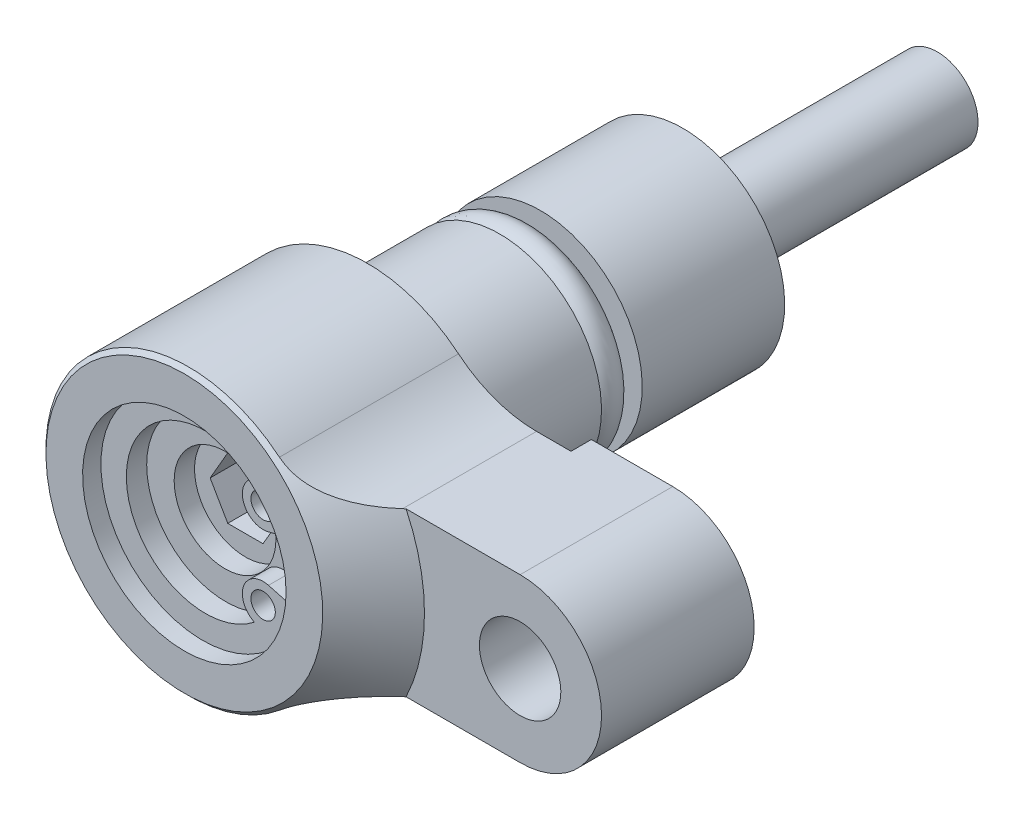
ISO-10303-21;
HEADER;
FILE_DESCRIPTION(('STEP AP214'),'2;1');
FILE_NAME('part.step','',(''),(''),'','','');
FILE_SCHEMA(('AUTOMOTIVE_DESIGN { 1 0 10303 214 1 1 1 1 }'));
ENDSEC;
DATA;
#1=APPLICATION_CONTEXT('core data for automotive mechanical design processes');
#2=APPLICATION_PROTOCOL_DEFINITION('international standard','automotive_design',2000,#1);
#3=PRODUCT_CONTEXT('',#1,'mechanical');
#4=PRODUCT('Part','Part','',(#3));
#5=PRODUCT_RELATED_PRODUCT_CATEGORY('part','',(#4));
#6=PRODUCT_DEFINITION_FORMATION('','',#4);
#7=PRODUCT_DEFINITION_CONTEXT('part definition',#1,'design');
#8=PRODUCT_DEFINITION('design','',#6,#7);
#9=PRODUCT_DEFINITION_SHAPE('','',#8);
#10=(LENGTH_UNIT() NAMED_UNIT(*) SI_UNIT(.MILLI.,.METRE.));
#11=(NAMED_UNIT(*) PLANE_ANGLE_UNIT() SI_UNIT($,.RADIAN.));
#12=(NAMED_UNIT(*) SI_UNIT($,.STERADIAN.) SOLID_ANGLE_UNIT());
#13=UNCERTAINTY_MEASURE_WITH_UNIT(LENGTH_MEASURE(1.E-05),#10,'distance_accuracy_value','');
#14=(GEOMETRIC_REPRESENTATION_CONTEXT(3) GLOBAL_UNCERTAINTY_ASSIGNED_CONTEXT((#13)) GLOBAL_UNIT_ASSIGNED_CONTEXT((#10,
#11,#12)) REPRESENTATION_CONTEXT('',''));
#15=CARTESIAN_POINT('',(0.,0.,0.));
#16=DIRECTION('',(0.,0.,1.));
#17=DIRECTION('',(1.,0.,0.));
#18=AXIS2_PLACEMENT_3D('',#15,#16,#17);
#19=CARTESIAN_POINT('',(-3.75,0.,-5.5));
#20=DIRECTION('',(0.,0.,-1.));
#21=DIRECTION('',(0.,-1.,0.));
#22=AXIS2_PLACEMENT_3D('',#19,#20,#21);
#23=PLANE('',#22);
#24=CARTESIAN_POINT('',(0.,0.,-5.5));
#25=DIRECTION('',(0.,0.,-1.));
#26=DIRECTION('',(0.,-1.,0.));
#27=AXIS2_PLACEMENT_3D('',#24,#25,#26);
#28=CIRCLE('',#27,5.);
#29=CARTESIAN_POINT('',(0.,-5.,-5.5));
#30=VERTEX_POINT('',#29);
#31=EDGE_CURVE('E150',#30,#30,#28,.T.);
#32=ORIENTED_EDGE('',*,*,#31,.T.);
#33=EDGE_LOOP('',(#32));
#34=FACE_BOUND('',#33,.T.);
#35=CARTESIAN_POINT('',(0.,0.,-5.5));
#36=DIRECTION('',(0.,0.,1.));
#37=DIRECTION('',(0.,-1.,0.));
#38=AXIS2_PLACEMENT_3D('',#35,#36,#37);
#39=CIRCLE('',#38,4.375);
#40=CARTESIAN_POINT('',(0.,-4.375,-5.5));
#41=VERTEX_POINT('',#40);
#42=EDGE_CURVE('E592',#41,#41,#39,.T.);
#43=ORIENTED_EDGE('',*,*,#42,.T.);
#44=EDGE_LOOP('',(#43));
#45=FACE_BOUND('',#44,.T.);
#46=ADVANCED_FACE('F14',(#34,#45),#23,.T.);
#47=CARTESIAN_POINT('',(0.,0.,8.));
#48=DIRECTION('',(0.,0.,-1.));
#49=DIRECTION('',(-0.335349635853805,0.942093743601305,0.));
#50=AXIS2_PLACEMENT_3D('',#47,#48,#49);
#51=CYLINDRICAL_SURFACE('',#50,2.5);
#52=CARTESIAN_POINT('',(0.,0.,8.));
#53=DIRECTION('',(0.,0.,1.));
#54=DIRECTION('',(0.335349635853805,-0.942093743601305,0.));
#55=AXIS2_PLACEMENT_3D('',#52,#53,#54);
#56=CIRCLE('',#55,2.5);
#57=CARTESIAN_POINT('',(0.838374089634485,-2.35523435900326,8.));
#58=VERTEX_POINT('',#57);
#59=EDGE_CURVE('E129',#58,#58,#56,.T.);
#60=ORIENTED_EDGE('',*,*,#59,.T.);
#61=EDGE_LOOP('',(#60));
#62=FACE_BOUND('',#61,.T.);
#63=CARTESIAN_POINT('',(0.,0.,7.));
#64=DIRECTION('',(0.,0.,-1.));
#65=DIRECTION('',(-1.,0.,0.));
#66=AXIS2_PLACEMENT_3D('',#63,#64,#65);
#67=CIRCLE('',#66,2.5);
#68=CARTESIAN_POINT('',(-2.50000000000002,0.,6.99999999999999));
#69=VERTEX_POINT('',#68);
#70=EDGE_CURVE('E18',#69,#69,#67,.T.);
#71=ORIENTED_EDGE('',*,*,#70,.T.);
#72=EDGE_LOOP('',(#71));
#73=FACE_BOUND('',#72,.T.);
#74=ADVANCED_FACE('F244',(#62,#73),#51,.F.);
#75=CARTESIAN_POINT('',(2.87075876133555,2.12283644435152,9.));
#76=DIRECTION('',(0.,0.,-1.));
#77=DIRECTION('',(-1.,0.,0.));
#78=AXIS2_PLACEMENT_3D('',#75,#76,#77);
#79=CYLINDRICAL_SURFACE('',#78,0.6);
#80=CARTESIAN_POINT('',(2.87075876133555,2.12283644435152,9.));
#81=DIRECTION('',(0.,0.,1.));
#82=DIRECTION('',(-1.,0.,0.));
#83=AXIS2_PLACEMENT_3D('',#80,#81,#82);
#84=CIRCLE('',#83,0.6);
#85=CARTESIAN_POINT('',(2.27075876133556,2.12283644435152,9.));
#86=VERTEX_POINT('',#85);
#87=EDGE_CURVE('E293',#86,#86,#84,.T.);
#88=ORIENTED_EDGE('',*,*,#87,.T.);
#89=EDGE_LOOP('',(#88));
#90=FACE_BOUND('',#89,.T.);
#91=CARTESIAN_POINT('',(2.87075876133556,2.12283644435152,8.));
#92=DIRECTION('',(0.,0.,1.));
#93=DIRECTION('',(-1.,0.,0.));
#94=AXIS2_PLACEMENT_3D('',#91,#92,#93);
#95=CIRCLE('',#94,0.6);
#96=CARTESIAN_POINT('',(2.27075876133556,2.12283644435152,8.));
#97=VERTEX_POINT('',#96);
#98=EDGE_CURVE('E297',#97,#97,#95,.T.);
#99=ORIENTED_EDGE('',*,*,#98,.F.);
#100=EDGE_LOOP('',(#99));
#101=FACE_BOUND('',#100,.T.);
#102=ADVANCED_FACE('F251',(#90,#101),#79,.F.);
#103=CARTESIAN_POINT('',(0.0360830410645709,0.,9.));
#104=DIRECTION('',(0.,0.,-1.));
#105=DIRECTION('',(-1.,0.,0.));
#106=AXIS2_PLACEMENT_3D('',#103,#104,#105);
#107=CYLINDRICAL_SURFACE('',#106,3.88608304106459);
#108=CARTESIAN_POINT('',(0.0360830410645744,0.,8.));
#109=DIRECTION('',(0.,0.,-1.));
#110=DIRECTION('',(1.,0.,0.));
#111=AXIS2_PLACEMENT_3D('',#108,#109,#110);
#112=CIRCLE('',#111,3.88608304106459);
#113=CARTESIAN_POINT('',(2.4443821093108,-3.04987491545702,8.));
#114=VERTEX_POINT('',#113);
#115=CARTESIAN_POINT('',(2.44438210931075,3.04987491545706,8.));
#116=VERTEX_POINT('',#115);
#117=EDGE_CURVE('E309',#114,#116,#112,.T.);
#118=ORIENTED_EDGE('',*,*,#117,.T.);
#119=DIRECTION('',(0.,0.,-1.));
#120=VECTOR('',#119,1.);
#121=CARTESIAN_POINT('',(2.44438210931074,3.04987491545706,9.));
#122=LINE('',#121,#120);
#123=CARTESIAN_POINT('',(2.44438210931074,3.04987491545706,9.));
#124=VERTEX_POINT('',#123);
#125=EDGE_CURVE('E321',#124,#116,#122,.T.);
#126=ORIENTED_EDGE('',*,*,#125,.F.);
#127=CARTESIAN_POINT('',(0.0360830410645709,0.,9.));
#128=DIRECTION('',(0.,0.,-1.));
#129=DIRECTION('',(1.,0.,0.));
#130=AXIS2_PLACEMENT_3D('',#127,#128,#129);
#131=CIRCLE('',#130,3.88608304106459);
#132=CARTESIAN_POINT('',(2.44438210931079,-3.04987491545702,9.));
#133=VERTEX_POINT('',#132);
#134=EDGE_CURVE('E33',#133,#124,#131,.T.);
#135=ORIENTED_EDGE('',*,*,#134,.F.);
#136=DIRECTION('',(0.,0.,-1.));
#137=VECTOR('',#136,1.);
#138=CARTESIAN_POINT('',(2.44438210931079,-3.04987491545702,9.));
#139=LINE('',#138,#137);
#140=EDGE_CURVE('E333',#133,#114,#139,.T.);
#141=ORIENTED_EDGE('',*,*,#140,.T.);
#142=EDGE_LOOP('',(#118,#126,#135,#141));
#143=FACE_BOUND('',#142,.T.);
#144=ADVANCED_FACE('F638',(#143),#107,.F.);
#145=CARTESIAN_POINT('',(2.87075876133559,-2.12283644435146,9.));
#146=DIRECTION('',(0.,0.,-1.));
#147=DIRECTION('',(-1.,0.,0.));
#148=AXIS2_PLACEMENT_3D('',#145,#146,#147);
#149=CYLINDRICAL_SURFACE('',#148,0.6);
#150=CARTESIAN_POINT('',(2.87075876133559,-2.12283644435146,9.));
#151=DIRECTION('',(0.,0.,1.));
#152=DIRECTION('',(1.,0.,0.));
#153=AXIS2_PLACEMENT_3D('',#150,#151,#152);
#154=CIRCLE('',#153,0.6);
#155=CARTESIAN_POINT('',(3.47075876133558,-2.12283644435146,9.));
#156=VERTEX_POINT('',#155);
#157=EDGE_CURVE('E300',#156,#156,#154,.T.);
#158=ORIENTED_EDGE('',*,*,#157,.T.);
#159=EDGE_LOOP('',(#158));
#160=FACE_BOUND('',#159,.T.);
#161=CARTESIAN_POINT('',(2.87075876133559,-2.12283644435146,8.));
#162=DIRECTION('',(0.,0.,1.));
#163=DIRECTION('',(1.,0.,0.));
#164=AXIS2_PLACEMENT_3D('',#161,#162,#163);
#165=CIRCLE('',#164,0.6);
#166=CARTESIAN_POINT('',(3.47075876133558,-2.12283644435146,8.));
#167=VERTEX_POINT('',#166);
#168=EDGE_CURVE('E296',#167,#167,#165,.T.);
#169=ORIENTED_EDGE('',*,*,#168,.F.);
#170=EDGE_LOOP('',(#169));
#171=FACE_BOUND('',#170,.T.);
#172=ADVANCED_FACE('F640',(#160,#171),#149,.F.);
#173=CARTESIAN_POINT('',(2.87075876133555,2.12283644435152,9.));
#174=DIRECTION('',(0.,0.,-1.));
#175=DIRECTION('',(-1.,0.,0.));
#176=AXIS2_PLACEMENT_3D('',#173,#174,#175);
#177=CYLINDRICAL_SURFACE('',#176,1.02039079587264);
#178=CARTESIAN_POINT('',(2.87075876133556,2.12283644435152,8.));
#179=DIRECTION('',(0.,0.,1.));
#180=DIRECTION('',(-1.,0.,0.));
#181=AXIS2_PLACEMENT_3D('',#178,#179,#180);
#182=CIRCLE('',#181,1.02039079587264);
#183=CARTESIAN_POINT('',(3.13485533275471,1.13721462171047,8.));
#184=VERTEX_POINT('',#183);
#185=EDGE_CURVE('E303',#116,#184,#182,.T.);
#186=ORIENTED_EDGE('',*,*,#185,.T.);
#187=DIRECTION('',(0.,0.,-1.));
#188=VECTOR('',#187,1.);
#189=CARTESIAN_POINT('',(3.13485533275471,1.13721462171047,9.));
#190=LINE('',#189,#188);
#191=CARTESIAN_POINT('',(3.13485533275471,1.13721462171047,9.));
#192=VERTEX_POINT('',#191);
#193=EDGE_CURVE('E9',#192,#184,#190,.T.);
#194=ORIENTED_EDGE('',*,*,#193,.F.);
#195=CARTESIAN_POINT('',(2.87075876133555,2.12283644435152,9.));
#196=DIRECTION('',(0.,0.,1.));
#197=DIRECTION('',(-1.,0.,0.));
#198=AXIS2_PLACEMENT_3D('',#195,#196,#197);
#199=CIRCLE('',#198,1.02039079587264);
#200=EDGE_CURVE('E306',#124,#192,#199,.T.);
#201=ORIENTED_EDGE('',*,*,#200,.F.);
#202=ORIENTED_EDGE('',*,*,#125,.T.);
#203=EDGE_LOOP('',(#186,#194,#201,#202));
#204=FACE_BOUND('',#203,.T.);
#205=ADVANCED_FACE('F643',(#204),#177,.T.);
#206=CARTESIAN_POINT('',(2.87075876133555,2.12283644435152,9.));
#207=DIRECTION('',(0.,0.,-1.));
#208=DIRECTION('',(-1.,0.,0.));
#209=AXIS2_PLACEMENT_3D('',#206,#207,#208);
#210=PLANE('',#209);
#211=ORIENTED_EDGE('',*,*,#157,.F.);
#212=EDGE_LOOP('',(#211));
#213=FACE_BOUND('',#212,.T.);
#214=ORIENTED_EDGE('',*,*,#200,.T.);
#215=DIRECTION('',(0.965925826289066,0.258819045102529,0.));
#216=VECTOR('',#215,1.);
#217=CARTESIAN_POINT('',(3.13485533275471,1.13721462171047,9.));
#218=LINE('',#217,#216);
#219=CARTESIAN_POINT('',(5.08594847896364,1.66000845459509,9.));
#220=VERTEX_POINT('',#219);
#221=EDGE_CURVE('E308',#192,#220,#218,.T.);
#222=ORIENTED_EDGE('',*,*,#221,.T.);
#223=CARTESIAN_POINT('',(0.,0.,9.));
#224=DIRECTION('',(0.,0.,1.));
#225=DIRECTION('',(1.,0.,0.));
#226=AXIS2_PLACEMENT_3D('',#223,#224,#225);
#227=CIRCLE('',#226,5.35);
#228=CARTESIAN_POINT('',(5.08594847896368,-1.66000845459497,9.));
#229=VERTEX_POINT('',#228);
#230=EDGE_CURVE('E312',#220,#229,#227,.T.);
#231=ORIENTED_EDGE('',*,*,#230,.T.);
#232=DIRECTION('',(-0.96592582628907,0.258819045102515,0.));
#233=VECTOR('',#232,1.);
#234=CARTESIAN_POINT('',(3.13485533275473,-1.13721462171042,9.));
#235=LINE('',#234,#233);
#236=CARTESIAN_POINT('',(3.13485533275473,-1.13721462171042,9.));
#237=VERTEX_POINT('',#236);
#238=EDGE_CURVE('E315',#229,#237,#235,.T.);
#239=ORIENTED_EDGE('',*,*,#238,.T.);
#240=CARTESIAN_POINT('',(2.87075876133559,-2.12283644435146,9.));
#241=DIRECTION('',(0.,0.,1.));
#242=DIRECTION('',(1.,0.,0.));
#243=AXIS2_PLACEMENT_3D('',#240,#241,#242);
#244=CIRCLE('',#243,1.02039079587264);
#245=EDGE_CURVE('E318',#237,#133,#244,.T.);
#246=ORIENTED_EDGE('',*,*,#245,.T.);
#247=ORIENTED_EDGE('',*,*,#134,.T.);
#248=EDGE_LOOP('',(#214,#222,#231,#239,#246,#247));
#249=FACE_BOUND('',#248,.T.);
#250=ORIENTED_EDGE('',*,*,#87,.F.);
#251=EDGE_LOOP('',(#250));
#252=FACE_BOUND('',#251,.T.);
#253=ADVANCED_FACE('F472',(#213,#249,#252),#210,.F.);
#254=CARTESIAN_POINT('',(2.87075876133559,-2.12283644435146,9.));
#255=DIRECTION('',(0.,0.,-1.));
#256=DIRECTION('',(-1.,0.,0.));
#257=AXIS2_PLACEMENT_3D('',#254,#255,#256);
#258=CYLINDRICAL_SURFACE('',#257,1.02039079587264);
#259=CARTESIAN_POINT('',(2.87075876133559,-2.12283644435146,8.));
#260=DIRECTION('',(0.,0.,1.));
#261=DIRECTION('',(1.,0.,0.));
#262=AXIS2_PLACEMENT_3D('',#259,#260,#261);
#263=CIRCLE('',#262,1.02039079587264);
#264=CARTESIAN_POINT('',(3.13485533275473,-1.13721462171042,8.));
#265=VERTEX_POINT('',#264);
#266=EDGE_CURVE('E328',#265,#114,#263,.T.);
#267=ORIENTED_EDGE('',*,*,#266,.T.);
#268=ORIENTED_EDGE('',*,*,#140,.F.);
#269=ORIENTED_EDGE('',*,*,#245,.F.);
#270=DIRECTION('',(0.,0.,-1.));
#271=VECTOR('',#270,1.);
#272=CARTESIAN_POINT('',(3.13485533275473,-1.13721462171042,9.));
#273=LINE('',#272,#271);
#274=EDGE_CURVE('E336',#237,#265,#273,.T.);
#275=ORIENTED_EDGE('',*,*,#274,.T.);
#276=EDGE_LOOP('',(#267,#268,#269,#275));
#277=FACE_BOUND('',#276,.T.);
#278=ADVANCED_FACE('F647',(#277),#258,.T.);
#279=CARTESIAN_POINT('',(3.13485533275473,-1.13721462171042,9.));
#280=DIRECTION('',(-0.258819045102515,-0.96592582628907,0.));
#281=DIRECTION('',(0.96592582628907,-0.258819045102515,0.));
#282=AXIS2_PLACEMENT_3D('',#279,#280,#281);
#283=PLANE('',#282);
#284=DIRECTION('',(-0.96592582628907,0.258819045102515,0.));
#285=VECTOR('',#284,1.);
#286=CARTESIAN_POINT('',(3.13485533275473,-1.13721462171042,8.));
#287=LINE('',#286,#285);
#288=CARTESIAN_POINT('',(5.08594847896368,-1.66000845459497,8.));
#289=VERTEX_POINT('',#288);
#290=EDGE_CURVE('E326',#289,#265,#287,.T.);
#291=ORIENTED_EDGE('',*,*,#290,.T.);
#292=ORIENTED_EDGE('',*,*,#274,.F.);
#293=ORIENTED_EDGE('',*,*,#238,.F.);
#294=DIRECTION('',(0.,0.,-1.));
#295=VECTOR('',#294,1.);
#296=CARTESIAN_POINT('',(5.08594847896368,-1.66000845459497,9.));
#297=LINE('',#296,#295);
#298=EDGE_CURVE('E339',#229,#289,#297,.T.);
#299=ORIENTED_EDGE('',*,*,#298,.T.);
#300=EDGE_LOOP('',(#291,#292,#293,#299));
#301=FACE_BOUND('',#300,.T.);
#302=ADVANCED_FACE('F423',(#301),#283,.F.);
#303=CARTESIAN_POINT('',(3.13485533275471,1.13721462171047,9.));
#304=DIRECTION('',(-0.258819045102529,0.965925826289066,0.));
#305=DIRECTION('',(-0.965925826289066,-0.258819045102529,0.));
#306=AXIS2_PLACEMENT_3D('',#303,#304,#305);
#307=PLANE('',#306);
#308=DIRECTION('',(0.965925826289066,0.258819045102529,0.));
#309=VECTOR('',#308,1.);
#310=CARTESIAN_POINT('',(3.13485533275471,1.13721462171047,8.));
#311=LINE('',#310,#309);
#312=CARTESIAN_POINT('',(5.08594847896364,1.66000845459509,8.));
#313=VERTEX_POINT('',#312);
#314=EDGE_CURVE('E323',#184,#313,#311,.T.);
#315=ORIENTED_EDGE('',*,*,#314,.T.);
#316=DIRECTION('',(0.,0.,-1.));
#317=VECTOR('',#316,1.);
#318=CARTESIAN_POINT('',(5.08594847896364,1.66000845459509,9.));
#319=LINE('',#318,#317);
#320=EDGE_CURVE('E24',#220,#313,#319,.T.);
#321=ORIENTED_EDGE('',*,*,#320,.F.);
#322=ORIENTED_EDGE('',*,*,#221,.F.);
#323=ORIENTED_EDGE('',*,*,#193,.T.);
#324=EDGE_LOOP('',(#315,#321,#322,#323));
#325=FACE_BOUND('',#324,.T.);
#326=ADVANCED_FACE('F417',(#325),#307,.F.);
#327=CARTESIAN_POINT('',(2.01727322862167E-13,0.,-57.7769681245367));
#328=DIRECTION('',(0.,0.,-1.));
#329=DIRECTION('',(0.,-1.,0.));
#330=AXIS2_PLACEMENT_3D('',#327,#328,#329);
#331=CYLINDRICAL_SURFACE('',#330,5.);
#332=ORIENTED_EDGE('',*,*,#31,.F.);
#333=EDGE_LOOP('',(#332));
#334=FACE_BOUND('',#333,.T.);
#335=CARTESIAN_POINT('',(0.,0.,1.));
#336=DIRECTION('',(0.,0.,-1.));
#337=DIRECTION('',(0.,-1.,0.));
#338=AXIS2_PLACEMENT_3D('',#335,#336,#337);
#339=CIRCLE('',#338,5.);
#340=CARTESIAN_POINT('',(0.,-5.,1.));
#341=VERTEX_POINT('',#340);
#342=EDGE_CURVE('E167',#341,#341,#339,.T.);
#343=ORIENTED_EDGE('',*,*,#342,.T.);
#344=EDGE_LOOP('',(#343));
#345=FACE_BOUND('',#344,.T.);
#346=ADVANCED_FACE('F255',(#334,#345),#331,.T.);
#347=CARTESIAN_POINT('',(8.30662386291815,-10.,0.));
#348=DIRECTION('',(0.,0.,-1.));
#349=DIRECTION('',(0.,-1.,0.));
#350=AXIS2_PLACEMENT_3D('',#347,#348,#349);
#351=PLANE('',#350);
#352=CARTESIAN_POINT('',(14.,0.,0.));
#353=DIRECTION('',(0.,0.,-1.));
#354=DIRECTION('',(1.,0.,0.));
#355=AXIS2_PLACEMENT_3D('',#352,#353,#354);
#356=CIRCLE('',#355,2.);
#357=CARTESIAN_POINT('',(16.,0.,0.));
#358=VERTEX_POINT('',#357);
#359=EDGE_CURVE('E595',#358,#358,#356,.T.);
#360=ORIENTED_EDGE('',*,*,#359,.F.);
#361=EDGE_LOOP('',(#360));
#362=FACE_BOUND('',#361,.T.);
#363=DIRECTION('',(0.,-1.,0.));
#364=VECTOR('',#363,1.);
#365=CARTESIAN_POINT('',(10.,-10.,0.));
#366=LINE('',#365,#364);
#367=CARTESIAN_POINT('',(10.,4.00000000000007,0.));
#368=VERTEX_POINT('',#367);
#369=CARTESIAN_POINT('',(10.,-3.99999999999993,0.));
#370=VERTEX_POINT('',#369);
#371=EDGE_CURVE('E162',#368,#370,#366,.T.);
#372=ORIENTED_EDGE('',*,*,#371,.F.);
#373=DIRECTION('',(-1.,0.,0.));
#374=VECTOR('',#373,1.);
#375=CARTESIAN_POINT('',(14.,4.0000000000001,0.));
#376=LINE('',#375,#374);
#377=CARTESIAN_POINT('',(14.,4.0000000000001,0.));
#378=VERTEX_POINT('',#377);
#379=EDGE_CURVE('E135',#378,#368,#376,.T.);
#380=ORIENTED_EDGE('',*,*,#379,.F.);
#381=CARTESIAN_POINT('',(14.,0.,0.));
#382=DIRECTION('',(0.,0.,1.));
#383=DIRECTION('',(0.,1.,0.));
#384=AXIS2_PLACEMENT_3D('',#381,#382,#383);
#385=CIRCLE('',#384,4.);
#386=CARTESIAN_POINT('',(14.,-3.9999999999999,0.));
#387=VERTEX_POINT('',#386);
#388=EDGE_CURVE('E140',#387,#378,#385,.T.);
#389=ORIENTED_EDGE('',*,*,#388,.F.);
#390=DIRECTION('',(1.,0.,0.));
#391=VECTOR('',#390,1.);
#392=CARTESIAN_POINT('',(14.,-3.9999999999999,0.));
#393=LINE('',#392,#391);
#394=EDGE_CURVE('E368',#370,#387,#393,.T.);
#395=ORIENTED_EDGE('',*,*,#394,.F.);
#396=EDGE_LOOP('',(#372,#380,#389,#395));
#397=FACE_BOUND('',#396,.T.);
#398=ADVANCED_FACE('F217',(#362,#397),#351,.T.);
#399=CARTESIAN_POINT('',(10.,9.5,1.00000000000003));
#400=DIRECTION('',(1.,0.,0.));
#401=DIRECTION('',(0.,1.,0.));
#402=AXIS2_PLACEMENT_3D('',#399,#400,#401);
#403=PLANE('',#402);
#404=DIRECTION('',(0.,-1.,0.));
#405=VECTOR('',#404,1.);
#406=CARTESIAN_POINT('',(10.,9.5,1.00000000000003));
#407=LINE('',#406,#405);
#408=CARTESIAN_POINT('',(10.,4.00000000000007,1.00000000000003));
#409=VERTEX_POINT('',#408);
#410=CARTESIAN_POINT('',(10.,-3.99999999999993,1.00000000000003));
#411=VERTEX_POINT('',#410);
#412=EDGE_CURVE('E386',#409,#411,#407,.T.);
#413=ORIENTED_EDGE('',*,*,#412,.F.);
#414=DIRECTION('',(0.,0.,1.));
#415=VECTOR('',#414,1.);
#416=CARTESIAN_POINT('',(10.,4.00000000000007,10.));
#417=LINE('',#416,#415);
#418=EDGE_CURVE('E105',#368,#409,#417,.T.);
#419=ORIENTED_EDGE('',*,*,#418,.F.);
#420=ORIENTED_EDGE('',*,*,#371,.T.);
#421=DIRECTION('',(0.,0.,-1.));
#422=VECTOR('',#421,1.);
#423=CARTESIAN_POINT('',(10.,-3.99999999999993,10.));
#424=LINE('',#423,#422);
#425=EDGE_CURVE('E370',#411,#370,#424,.T.);
#426=ORIENTED_EDGE('',*,*,#425,.F.);
#427=EDGE_LOOP('',(#413,#419,#420,#426));
#428=FACE_BOUND('',#427,.T.);
#429=ADVANCED_FACE('F228',(#428),#403,.F.);
#430=CARTESIAN_POINT('',(14.,0.,10.));
#431=DIRECTION('',(0.,0.,-1.));
#432=DIRECTION('',(0.,-1.,0.));
#433=AXIS2_PLACEMENT_3D('',#430,#431,#432);
#434=CYLINDRICAL_SURFACE('',#433,4.);
#435=DIRECTION('',(0.,0.,-1.));
#436=VECTOR('',#435,1.);
#437=CARTESIAN_POINT('',(14.,4.0000000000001,10.));
#438=LINE('',#437,#436);
#439=CARTESIAN_POINT('',(14.,4.0000000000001,7.5));
#440=VERTEX_POINT('',#439);
#441=EDGE_CURVE('E145',#440,#378,#438,.T.);
#442=ORIENTED_EDGE('',*,*,#441,.F.);
#443=CARTESIAN_POINT('',(14.,0.,7.5));
#444=DIRECTION('',(0.,0.,-1.));
#445=DIRECTION('',(0.,-1.,0.));
#446=AXIS2_PLACEMENT_3D('',#443,#444,#445);
#447=CIRCLE('',#446,4.);
#448=CARTESIAN_POINT('',(14.,-3.9999999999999,7.5));
#449=VERTEX_POINT('',#448);
#450=EDGE_CURVE('E354',#440,#449,#447,.T.);
#451=ORIENTED_EDGE('',*,*,#450,.T.);
#452=DIRECTION('',(0.,0.,-1.));
#453=VECTOR('',#452,1.);
#454=CARTESIAN_POINT('',(14.,-3.9999999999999,10.));
#455=LINE('',#454,#453);
#456=EDGE_CURVE('E147',#449,#387,#455,.T.);
#457=ORIENTED_EDGE('',*,*,#456,.T.);
#458=ORIENTED_EDGE('',*,*,#388,.T.);
#459=EDGE_LOOP('',(#442,#451,#457,#458));
#460=FACE_BOUND('',#459,.T.);
#461=ADVANCED_FACE('F226',(#460),#434,.T.);
#462=CARTESIAN_POINT('',(0.,0.,1.));
#463=DIRECTION('',(0.,0.,-1.));
#464=DIRECTION('',(0.,-1.,0.));
#465=AXIS2_PLACEMENT_3D('',#462,#463,#464);
#466=PLANE('',#465);
#467=ORIENTED_EDGE('',*,*,#342,.F.);
#468=EDGE_LOOP('',(#467));
#469=FACE_BOUND('',#468,.T.);
#470=DIRECTION('',(-1.,0.,0.));
#471=VECTOR('',#470,1.);
#472=CARTESIAN_POINT('',(14.,-3.9999999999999,1.00000000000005));
#473=LINE('',#472,#471);
#474=CARTESIAN_POINT('',(8.30662386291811,-3.99999999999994,1.00000000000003));
#475=VERTEX_POINT('',#474);
#476=EDGE_CURVE('E372',#411,#475,#473,.T.);
#477=ORIENTED_EDGE('',*,*,#476,.T.);
#478=CARTESIAN_POINT('',(8.30662386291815,-10.,1.00000000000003));
#479=DIRECTION('',(0.,0.,-1.));
#480=DIRECTION('',(0.,-1.,0.));
#481=AXIS2_PLACEMENT_3D('',#478,#479,#480);
#482=CIRCLE('',#481,6.);
#483=CARTESIAN_POINT('',(4.47279746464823,-5.38461538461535,1.00000000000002));
#484=VERTEX_POINT('',#483);
#485=EDGE_CURVE('E377',#475,#484,#482,.F.);
#486=ORIENTED_EDGE('',*,*,#485,.T.);
#487=CARTESIAN_POINT('',(0.,0.,1.));
#488=DIRECTION('',(0.,0.,-1.));
#489=DIRECTION('',(0.,-1.,0.));
#490=AXIS2_PLACEMENT_3D('',#487,#488,#489);
#491=CIRCLE('',#490,7.);
#492=CARTESIAN_POINT('',(4.47279746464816,5.38461538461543,1.00000000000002));
#493=VERTEX_POINT('',#492);
#494=EDGE_CURVE('E130',#484,#493,#491,.T.);
#495=ORIENTED_EDGE('',*,*,#494,.T.);
#496=CARTESIAN_POINT('',(8.30662386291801,10.,1.00000000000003));
#497=DIRECTION('',(0.,0.,-1.));
#498=DIRECTION('',(0.,-1.,0.));
#499=AXIS2_PLACEMENT_3D('',#496,#497,#498);
#500=CIRCLE('',#499,6.);
#501=CARTESIAN_POINT('',(8.30662386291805,4.00000000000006,1.00000000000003));
#502=VERTEX_POINT('',#501);
#503=EDGE_CURVE('E381',#493,#502,#500,.F.);
#504=ORIENTED_EDGE('',*,*,#503,.T.);
#505=DIRECTION('',(1.,0.,0.));
#506=VECTOR('',#505,1.);
#507=CARTESIAN_POINT('',(14.,4.0000000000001,1.00000000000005));
#508=LINE('',#507,#506);
#509=EDGE_CURVE('E379',#502,#409,#508,.T.);
#510=ORIENTED_EDGE('',*,*,#509,.T.);
#511=ORIENTED_EDGE('',*,*,#412,.T.);
#512=EDGE_LOOP('',(#477,#486,#495,#504,#510,#511));
#513=FACE_BOUND('',#512,.T.);
#514=ADVANCED_FACE('F223',(#469,#513),#466,.T.);
#515=CARTESIAN_POINT('',(14.,4.0000000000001,10.));
#516=DIRECTION('',(0.,-1.,0.));
#517=DIRECTION('',(1.,0.,0.));
#518=AXIS2_PLACEMENT_3D('',#515,#516,#517);
#519=PLANE('',#518);
#520=CARTESIAN_POINT('',(4.32448185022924,4.,10.9092323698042));
#521=CARTESIAN_POINT('',(4.41530071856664,4.00000000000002,10.8425559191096));
#522=CARTESIAN_POINT('',(4.50566058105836,4.00000000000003,10.7752590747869));
#523=CARTESIAN_POINT('',(4.68555030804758,4.00000000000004,10.6395713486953));
#524=CARTESIAN_POINT('',(4.77508020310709,4.00000000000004,10.5711805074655));
#525=CARTESIAN_POINT('',(5.04253765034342,4.00000000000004,10.3646022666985));
#526=CARTESIAN_POINT('',(5.21936276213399,4.00000000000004,10.2249871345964));
#527=CARTESIAN_POINT('',(5.57055532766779,4.00000000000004,9.94287482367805));
#528=CARTESIAN_POINT('',(5.74492387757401,4.00000000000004,9.80037900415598));
#529=CARTESIAN_POINT('',(6.0917283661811,4.00000000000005,9.51304210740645));
#530=CARTESIAN_POINT('',(6.26416421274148,4.00000000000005,9.36820091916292));
#531=CARTESIAN_POINT('',(6.7788166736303,4.00000000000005,8.93111364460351));
#532=CARTESIAN_POINT('',(7.11865997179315,4.00000000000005,8.63607490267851));
#533=CARTESIAN_POINT('',(7.79397091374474,4.00000000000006,8.04096554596));
#534=CARTESIAN_POINT('',(8.12943794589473,4.00000000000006,7.74089424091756));
#535=CARTESIAN_POINT('',(8.79687426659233,4.00000000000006,7.13745932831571));
#536=CARTESIAN_POINT('',(9.12884628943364,4.00000000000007,6.83409874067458));
#537=CARTESIAN_POINT('',(9.79037541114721,4.00000000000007,6.22479735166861));
#538=CARTESIAN_POINT('',(10.1199326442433,4.00000000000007,5.91885669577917));
#539=CARTESIAN_POINT('',(10.7774506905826,4.00000000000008,5.30480244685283));
#540=CARTESIAN_POINT('',(11.1054102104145,4.00000000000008,4.99668747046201));
#541=CARTESIAN_POINT('',(11.7598878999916,4.00000000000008,4.37890628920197));
#542=CARTESIAN_POINT('',(12.0864060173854,4.00000000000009,4.06924002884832));
#543=CARTESIAN_POINT('',(12.4123866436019,4.00000000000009,3.75901299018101));
#544=B_SPLINE_CURVE_WITH_KNOTS('',3,(#520,#521,#522,#523,#524,#525,#526,#527,#528,#529,#530,
#531,#532,#533,#534,#535,#536,#537,#538,#539,#540,#541,#542,#543),.UNSPECIFIED.,.F.,.F.,(4,2,2,
2,2,2,2,2,2,2,2,4),(0.,0.337993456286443,0.675974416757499,1.35182521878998,2.02736422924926,
2.70293530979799,4.05298858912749,5.40322857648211,6.75231920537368,8.10133426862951,
9.45130309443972,10.8013205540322),.UNSPECIFIED.);
#545=CARTESIAN_POINT('',(8.30662386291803,4.00000000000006,7.58045554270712));
#546=VERTEX_POINT('',#545);
#547=CARTESIAN_POINT('',(8.39583229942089,4.00000000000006,7.5));
#548=VERTEX_POINT('',#547);
#549=EDGE_CURVE('E206',#546,#548,#544,.T.);
#550=ORIENTED_EDGE('',*,*,#549,.T.);
#551=DIRECTION('',(1.,0.,0.));
#552=VECTOR('',#551,1.);
#553=CARTESIAN_POINT('',(14.,4.0000000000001,7.5));
#554=LINE('',#553,#552);
#555=EDGE_CURVE('E356',#548,#440,#554,.T.);
#556=ORIENTED_EDGE('',*,*,#555,.T.);
#557=ORIENTED_EDGE('',*,*,#441,.T.);
#558=ORIENTED_EDGE('',*,*,#379,.T.);
#559=ORIENTED_EDGE('',*,*,#418,.T.);
#560=ORIENTED_EDGE('',*,*,#509,.F.);
#561=DIRECTION('',(0.,0.,-1.));
#562=VECTOR('',#561,1.);
#563=CARTESIAN_POINT('',(8.30662386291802,4.00000000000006,10.));
#564=LINE('',#563,#562);
#565=EDGE_CURVE('E137',#546,#502,#564,.T.);
#566=ORIENTED_EDGE('',*,*,#565,.F.);
#567=EDGE_LOOP('',(#550,#556,#557,#558,#559,#560,#566));
#568=FACE_BOUND('',#567,.T.);
#569=ADVANCED_FACE('F219',(#568),#519,.F.);
#570=CARTESIAN_POINT('',(24.4548260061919,1.70767236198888E-13,7.50000000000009));
#571=DIRECTION('',(0.,0.,-1.));
#572=DIRECTION('',(0.,-1.,0.));
#573=AXIS2_PLACEMENT_3D('',#570,#571,#572);
#574=PLANE('',#573);
#575=CARTESIAN_POINT('',(14.,0.,7.5));
#576=DIRECTION('',(0.,0.,1.));
#577=DIRECTION('',(0.,-1.,0.));
#578=AXIS2_PLACEMENT_3D('',#575,#576,#577);
#579=CIRCLE('',#578,2.);
#580=CARTESIAN_POINT('',(14.,-1.9999999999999,7.5));
#581=VERTEX_POINT('',#580);
#582=EDGE_CURVE('E935',#581,#581,#579,.T.);
#583=ORIENTED_EDGE('',*,*,#582,.F.);
#584=EDGE_LOOP('',(#583));
#585=FACE_BOUND('',#584,.T.);
#586=CARTESIAN_POINT('',(0.,0.,7.5));
#587=DIRECTION('',(0.,0.,1.));
#588=DIRECTION('',(0.,1.,0.));
#589=AXIS2_PLACEMENT_3D('',#586,#587,#588);
#590=CIRCLE('',#589,9.3);
#591=CARTESIAN_POINT('',(8.39583229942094,-3.99999999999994,7.5));
#592=VERTEX_POINT('',#591);
#593=EDGE_CURVE('E348',#592,#548,#590,.T.);
#594=ORIENTED_EDGE('',*,*,#593,.F.);
#595=DIRECTION('',(-1.,0.,0.));
#596=VECTOR('',#595,1.);
#597=CARTESIAN_POINT('',(14.,-3.9999999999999,7.5));
#598=LINE('',#597,#596);
#599=EDGE_CURVE('E351',#449,#592,#598,.T.);
#600=ORIENTED_EDGE('',*,*,#599,.F.);
#601=ORIENTED_EDGE('',*,*,#450,.F.);
#602=ORIENTED_EDGE('',*,*,#555,.F.);
#603=EDGE_LOOP('',(#594,#600,#601,#602));
#604=FACE_BOUND('',#603,.T.);
#605=ADVANCED_FACE('F185',(#585,#604),#574,.F.);
#606=CARTESIAN_POINT('',(14.,-3.9999999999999,10.));
#607=DIRECTION('',(0.,1.,0.));
#608=DIRECTION('',(-1.,0.,0.));
#609=AXIS2_PLACEMENT_3D('',#606,#607,#608);
#610=PLANE('',#609);
#611=ORIENTED_EDGE('',*,*,#456,.F.);
#612=ORIENTED_EDGE('',*,*,#599,.T.);
#613=CARTESIAN_POINT('',(12.412386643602,-3.99999999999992,3.75901299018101));
#614=CARTESIAN_POINT('',(12.0864060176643,-3.99999999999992,4.06924002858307));
#615=CARTESIAN_POINT('',(11.7598879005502,-3.99999999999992,4.37890628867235));
#616=CARTESIAN_POINT('',(11.1054102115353,-3.99999999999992,4.99668746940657));
#617=CARTESIAN_POINT('',(10.777450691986,-3.99999999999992,5.30480244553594));
#618=CARTESIAN_POINT('',(10.1199326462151,-3.99999999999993,5.91885669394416));
#619=CARTESIAN_POINT('',(9.79037541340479,-3.99999999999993,6.22479734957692));
#620=CARTESIAN_POINT('',(9.12884629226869,-3.99999999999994,6.83409873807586));
#621=CARTESIAN_POINT('',(8.79687426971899,-3.99999999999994,7.13745932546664));
#622=CARTESIAN_POINT('',(8.12943794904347,-3.99999999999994,7.74089423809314));
#623=CARTESIAN_POINT('',(7.79397091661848,-3.99999999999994,8.04096554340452));
#624=CARTESIAN_POINT('',(7.11865997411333,-3.99999999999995,8.63607490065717));
#625=CARTESIAN_POINT('',(6.77881667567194,-3.99999999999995,8.93111364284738));
#626=CARTESIAN_POINT('',(6.26416421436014,-3.99999999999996,9.3682009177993));
#627=CARTESIAN_POINT('',(6.09172836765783,-3.99999999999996,9.51304210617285));
#628=CARTESIAN_POINT('',(5.74492387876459,-3.99999999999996,9.80037900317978));
#629=CARTESIAN_POINT('',(5.57055532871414,-3.99999999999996,9.94287482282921));
#630=CARTESIAN_POINT('',(5.21936276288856,-3.99999999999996,10.2249871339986));
#631=CARTESIAN_POINT('',(5.04253765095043,-3.99999999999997,10.3646022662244));
#632=CARTESIAN_POINT('',(4.77508020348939,-3.99999999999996,10.5711805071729));
#633=CARTESIAN_POINT('',(4.6855503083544,-3.99999999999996,10.6395713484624));
#634=CARTESIAN_POINT('',(4.50566058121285,-3.99999999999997,10.7752590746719));
#635=CARTESIAN_POINT('',(4.4153007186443,-3.99999999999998,10.8425559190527));
#636=CARTESIAN_POINT('',(4.32448185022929,-4.,10.9092323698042));
#637=B_SPLINE_CURVE_WITH_KNOTS('',3,(#613,#614,#615,#616,#617,#618,#619,#620,#621,#622,#623,
#624,#625,#626,#627,#628,#629,#630,#631,#632,#633,#634,#635,#636),.UNSPECIFIED.,.F.,.F.,(4,2,2,
2,2,2,2,2,2,2,2,4),(0.,1.35001745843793,2.69998628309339,4.04900134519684,5.39809197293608,
6.7483319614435,8.09838524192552,8.77395632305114,9.44949533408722,10.1253461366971,
10.4633270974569,10.8013205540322),.UNSPECIFIED.);
#638=CARTESIAN_POINT('',(8.30662386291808,-3.99999999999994,7.58045554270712));
#639=VERTEX_POINT('',#638);
#640=EDGE_CURVE('E120',#592,#639,#637,.T.);
#641=ORIENTED_EDGE('',*,*,#640,.T.);
#642=DIRECTION('',(0.,0.,-1.));
#643=VECTOR('',#642,1.);
#644=CARTESIAN_POINT('',(8.30662386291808,-3.99999999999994,10.));
#645=LINE('',#644,#643);
#646=EDGE_CURVE('E128',#639,#475,#645,.T.);
#647=ORIENTED_EDGE('',*,*,#646,.T.);
#648=ORIENTED_EDGE('',*,*,#476,.F.);
#649=ORIENTED_EDGE('',*,*,#425,.T.);
#650=ORIENTED_EDGE('',*,*,#394,.T.);
#651=EDGE_LOOP('',(#611,#612,#641,#647,#648,#649,#650));
#652=FACE_BOUND('',#651,.T.);
#653=ADVANCED_FACE('F225',(#652),#610,.F.);
#654=CARTESIAN_POINT('',(8.30662386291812,-10.,10.));
#655=DIRECTION('',(0.,0.,-1.));
#656=DIRECTION('',(0.,-1.,0.));
#657=AXIS2_PLACEMENT_3D('',#654,#655,#656);
#658=CYLINDRICAL_SURFACE('',#657,6.);
#659=ORIENTED_EDGE('',*,*,#646,.F.);
#660=CARTESIAN_POINT('',(8.30682386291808,-4.00000000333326,7.58027534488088));
#661=CARTESIAN_POINT('',(8.22352847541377,-4.00000112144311,7.6553180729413));
#662=CARTESIAN_POINT('',(8.13976490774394,-4.0017286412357,7.729831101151));
#663=CARTESIAN_POINT('',(7.97123985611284,-4.00878629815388,7.87759198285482));
#664=CARTESIAN_POINT('',(7.88647810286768,-4.01411743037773,7.95083948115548));
#665=CARTESIAN_POINT('',(7.62960433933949,-4.0358300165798,8.16922117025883));
#666=CARTESIAN_POINT('',(7.45594661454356,-4.05793468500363,8.312048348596));
#667=CARTESIAN_POINT('',(7.09783707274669,-4.12010883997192,8.59385106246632));
#668=CARTESIAN_POINT('',(6.91322422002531,-4.16081747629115,8.73248438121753));
#669=CARTESIAN_POINT('',(6.53967434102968,-4.26281894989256,8.99495657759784));
#670=CARTESIAN_POINT('',(6.35075186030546,-4.32405000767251,9.11883836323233));
#671=CARTESIAN_POINT('',(6.07923142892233,-4.42809226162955,9.27936568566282));
#672=CARTESIAN_POINT('',(5.99821623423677,-4.46113011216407,9.32508561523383));
#673=CARTESIAN_POINT('',(5.8356455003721,-4.53171450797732,9.41182123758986));
#674=CARTESIAN_POINT('',(5.75408990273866,-4.56926154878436,9.45283641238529));
#675=CARTESIAN_POINT('',(5.51088491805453,-4.6881265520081,9.56660967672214));
#676=CARTESIAN_POINT('',(5.34858452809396,-4.77646095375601,9.63138105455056));
#677=CARTESIAN_POINT('',(5.12696489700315,-4.91130034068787,9.70057003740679));
#678=CARTESIAN_POINT('',(5.06638030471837,-4.94964977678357,9.71746919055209));
#679=CARTESIAN_POINT('',(4.94587972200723,-5.02902489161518,9.74678537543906));
#680=CARTESIAN_POINT('',(4.88596355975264,-5.0700498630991,9.75920358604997));
#681=CARTESIAN_POINT('',(4.76629685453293,-5.15525543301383,9.77939538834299));
#682=CARTESIAN_POINT('',(4.70656071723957,-5.19947253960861,9.78710059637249));
#683=CARTESIAN_POINT('',(4.58845014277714,-5.29035347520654,9.79741951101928));
#684=CARTESIAN_POINT('',(4.53007687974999,-5.33701930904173,9.80002897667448));
#685=CARTESIAN_POINT('',(4.47259746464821,-5.38478152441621,9.79999998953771));
#686=B_SPLINE_CURVE_WITH_KNOTS('',3,(#660,#661,#662,#663,#664,#665,#666,#667,#668,#669,#670,
#671,#672,#673,#674,#675,#676,#677,#678,#679,#680,#681,#682,#683,#684,#685),.UNSPECIFIED.,.F.,
.F.,(4,2,2,2,2,2,2,2,2,2,2,2,4),(0.,0.336308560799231,0.672710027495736,1.34972747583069,
2.05199004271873,2.75215726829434,3.04811349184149,3.34410226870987,3.92834845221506,
4.14920827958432,4.37000995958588,4.59394375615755,4.81806384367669),.UNSPECIFIED.);
#687=CARTESIAN_POINT('',(4.47279746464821,-5.38461538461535,9.8));
#688=VERTEX_POINT('',#687);
#689=EDGE_CURVE('E113',#639,#688,#686,.T.);
#690=ORIENTED_EDGE('',*,*,#689,.T.);
#691=DIRECTION('',(0.,0.,-1.));
#692=VECTOR('',#691,1.);
#693=CARTESIAN_POINT('',(4.47279746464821,-5.38461538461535,10.));
#694=LINE('',#693,#692);
#695=EDGE_CURVE('E126',#688,#484,#694,.T.);
#696=ORIENTED_EDGE('',*,*,#695,.T.);
#697=ORIENTED_EDGE('',*,*,#485,.F.);
#698=EDGE_LOOP('',(#659,#690,#696,#697));
#699=FACE_BOUND('',#698,.T.);
#700=ADVANCED_FACE('F124',(#699),#658,.F.);
#701=CARTESIAN_POINT('',(0.,0.,10.));
#702=DIRECTION('',(0.,0.,-1.));
#703=DIRECTION('',(0.,-1.,0.));
#704=AXIS2_PLACEMENT_3D('',#701,#702,#703);
#705=CYLINDRICAL_SURFACE('',#704,7.);
#706=ORIENTED_EDGE('',*,*,#695,.F.);
#707=CARTESIAN_POINT('',(0.,0.,9.8));
#708=DIRECTION('',(0.,0.,-1.));
#709=DIRECTION('',(0.,-1.,0.));
#710=AXIS2_PLACEMENT_3D('',#707,#708,#709);
#711=CIRCLE('',#710,7.);
#712=CARTESIAN_POINT('',(4.47279746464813,5.38461538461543,9.8));
#713=VERTEX_POINT('',#712);
#714=EDGE_CURVE('E110',#688,#713,#711,.T.);
#715=ORIENTED_EDGE('',*,*,#714,.T.);
#716=DIRECTION('',(0.,0.,-1.));
#717=VECTOR('',#716,1.);
#718=CARTESIAN_POINT('',(4.47279746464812,5.38461538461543,10.));
#719=LINE('',#718,#717);
#720=EDGE_CURVE('E134',#713,#493,#719,.T.);
#721=ORIENTED_EDGE('',*,*,#720,.T.);
#722=ORIENTED_EDGE('',*,*,#494,.F.);
#723=EDGE_LOOP('',(#706,#715,#721,#722));
#724=FACE_BOUND('',#723,.T.);
#725=ADVANCED_FACE('F132',(#724),#705,.T.);
#726=CARTESIAN_POINT('',(8.30662386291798,10.,10.));
#727=DIRECTION('',(0.,0.,-1.));
#728=DIRECTION('',(0.,-1.,0.));
#729=AXIS2_PLACEMENT_3D('',#726,#727,#728);
#730=CYLINDRICAL_SURFACE('',#729,6.);
#731=ORIENTED_EDGE('',*,*,#720,.F.);
#732=CARTESIAN_POINT('',(4.47259746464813,5.38478152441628,9.79999998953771));
#733=CARTESIAN_POINT('',(4.55013417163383,5.32033019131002,9.80008169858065));
#734=CARTESIAN_POINT('',(4.62929361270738,5.25791073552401,9.7952988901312));
#735=CARTESIAN_POINT('',(4.78977179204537,5.13772873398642,9.77658247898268));
#736=CARTESIAN_POINT('',(4.87108553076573,5.07995647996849,9.76266854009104));
#737=CARTESIAN_POINT('',(5.03345400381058,4.97050900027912,9.72663487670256));
#738=CARTESIAN_POINT('',(5.11448019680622,4.9187334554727,9.7046882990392));
#739=CARTESIAN_POINT('',(5.27720620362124,4.82006901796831,9.65342208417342));
#740=CARTESIAN_POINT('',(5.3589063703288,4.77318288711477,9.62409831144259));
#741=CARTESIAN_POINT('',(5.54353639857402,4.67279954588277,9.55060001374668));
#742=CARTESIAN_POINT('',(5.64649264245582,4.62072817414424,9.50454608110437));
#743=CARTESIAN_POINT('',(5.85176716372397,4.52400128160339,9.40409402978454));
#744=CARTESIAN_POINT('',(5.95408524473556,4.4793479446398,9.34969346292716));
#745=CARTESIAN_POINT('',(6.26228388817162,4.35462144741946,9.17485413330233));
#746=CARTESIAN_POINT('',(6.46662557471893,4.28525857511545,9.04396329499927));
#747=CARTESIAN_POINT('',(6.81206010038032,4.18719743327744,8.80472221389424));
#748=CARTESIAN_POINT('',(6.95457177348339,4.15254355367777,8.70058873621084));
#749=CARTESIAN_POINT('',(7.23699754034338,4.09435159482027,8.48563902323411));
#750=CARTESIAN_POINT('',(7.37690956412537,4.0708220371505,8.37481773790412));
#751=CARTESIAN_POINT('',(7.6499369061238,4.03450070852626,8.15174184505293));
#752=CARTESIAN_POINT('',(7.78313036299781,4.02140891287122,8.03962916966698));
#753=CARTESIAN_POINT('',(8.04686705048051,4.00418006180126,7.81216259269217));
#754=CARTESIAN_POINT('',(8.17741496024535,4.00002552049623,7.69681546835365));
#755=CARTESIAN_POINT('',(8.30682386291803,4.00000000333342,7.58027534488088));
#756=B_SPLINE_CURVE_WITH_KNOTS('',3,(#732,#733,#734,#735,#736,#737,#738,#739,#740,#741,#742,
#743,#744,#745,#746,#747,#748,#749,#750,#751,#752,#753,#754,#755),.UNSPECIFIED.,.F.,.F.,(4,2,2,
2,2,2,2,2,2,2,2,4),(0.,0.302251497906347,0.603854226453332,0.89930569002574,1.19492314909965,
1.56698732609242,1.93916084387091,2.69348566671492,3.23269430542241,3.77231532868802,
4.29580165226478,4.81826283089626),.UNSPECIFIED.);
#757=EDGE_CURVE('E116',#713,#546,#756,.T.);
#758=ORIENTED_EDGE('',*,*,#757,.T.);
#759=ORIENTED_EDGE('',*,*,#565,.T.);
#760=ORIENTED_EDGE('',*,*,#503,.F.);
#761=EDGE_LOOP('',(#731,#758,#759,#760));
#762=FACE_BOUND('',#761,.T.);
#763=ADVANCED_FACE('F183',(#762),#730,.F.);
#764=CARTESIAN_POINT('',(0.,0.,7.5));
#765=DIRECTION('',(0.,0.,-1.));
#766=DIRECTION('',(0.,-1.,0.));
#767=AXIS2_PLACEMENT_3D('',#764,#765,#766);
#768=CONICAL_SURFACE('',#767,9.3,0.78539816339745);
#769=CARTESIAN_POINT('',(0.,0.,10.));
#770=DIRECTION('',(0.,0.,1.));
#771=DIRECTION('',(0.,1.,0.));
#772=AXIS2_PLACEMENT_3D('',#769,#770,#771);
#773=CIRCLE('',#772,6.8);
#774=CARTESIAN_POINT('',(0.,6.8,10.));
#775=VERTEX_POINT('',#774);
#776=EDGE_CURVE('E292',#775,#775,#773,.T.);
#777=ORIENTED_EDGE('',*,*,#776,.F.);
#778=EDGE_LOOP('',(#777));
#779=FACE_BOUND('',#778,.T.);
#780=ORIENTED_EDGE('',*,*,#757,.F.);
#781=ORIENTED_EDGE('',*,*,#714,.F.);
#782=ORIENTED_EDGE('',*,*,#689,.F.);
#783=ORIENTED_EDGE('',*,*,#640,.F.);
#784=ORIENTED_EDGE('',*,*,#593,.T.);
#785=ORIENTED_EDGE('',*,*,#549,.F.);
#786=EDGE_LOOP('',(#780,#781,#782,#783,#784,#785));
#787=FACE_BOUND('',#786,.T.);
#788=ADVANCED_FACE('F112',(#779,#787),#768,.T.);
#789=CARTESIAN_POINT('',(8.30662386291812,-10.,10.));
#790=DIRECTION('',(0.,0.,-1.));
#791=DIRECTION('',(0.,-1.,0.));
#792=AXIS2_PLACEMENT_3D('',#789,#790,#791);
#793=PLANE('',#792);
#794=ORIENTED_EDGE('',*,*,#776,.T.);
#795=EDGE_LOOP('',(#794));
#796=FACE_BOUND('',#795,.T.);
#797=CARTESIAN_POINT('',(0.,0.,10.));
#798=DIRECTION('',(0.,0.,-1.));
#799=DIRECTION('',(0.,-1.,0.));
#800=AXIS2_PLACEMENT_3D('',#797,#798,#799);
#801=CIRCLE('',#800,5.);
#802=CARTESIAN_POINT('',(0.,-5.,10.));
#803=VERTEX_POINT('',#802);
#804=EDGE_CURVE('E165',#803,#803,#801,.F.);
#805=ORIENTED_EDGE('',*,*,#804,.F.);
#806=EDGE_LOOP('',(#805));
#807=FACE_BOUND('',#806,.T.);
#808=ADVANCED_FACE('F182',(#796,#807),#793,.F.);
#809=CARTESIAN_POINT('',(0.,0.,18.2882060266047));
#810=DIRECTION('',(0.,0.,1.));
#811=DIRECTION('',(1.,0.,0.));
#812=AXIS2_PLACEMENT_3D('',#809,#810,#811);
#813=CYLINDRICAL_SURFACE('',#812,5.);
#814=CARTESIAN_POINT('',(0.,0.,9.1));
#815=DIRECTION('',(0.,0.,1.));
#816=DIRECTION('',(1.,0.,0.));
#817=AXIS2_PLACEMENT_3D('',#814,#815,#816);
#818=CIRCLE('',#817,5.);
#819=CARTESIAN_POINT('',(4.99999999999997,0.,9.10000000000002));
#820=VERTEX_POINT('',#819);
#821=EDGE_CURVE('E392',#820,#820,#818,.T.);
#822=ORIENTED_EDGE('',*,*,#821,.F.);
#823=EDGE_LOOP('',(#822));
#824=FACE_BOUND('',#823,.T.);
#825=ORIENTED_EDGE('',*,*,#804,.T.);
#826=EDGE_LOOP('',(#825));
#827=FACE_BOUND('',#826,.T.);
#828=ADVANCED_FACE('F239',(#824,#827),#813,.F.);
#829=CARTESIAN_POINT('',(-5.,0.,9.1));
#830=DIRECTION('',(0.,0.,-1.));
#831=DIRECTION('',(-1.,0.,0.));
#832=AXIS2_PLACEMENT_3D('',#829,#830,#831);
#833=PLANE('',#832);
#834=ORIENTED_EDGE('',*,*,#821,.T.);
#835=EDGE_LOOP('',(#834));
#836=FACE_BOUND('',#835,.T.);
#837=CARTESIAN_POINT('',(0.,0.,9.1));
#838=DIRECTION('',(0.,0.,1.));
#839=DIRECTION('',(1.,0.,0.));
#840=AXIS2_PLACEMENT_3D('',#837,#838,#839);
#841=CIRCLE('',#840,5.35);
#842=CARTESIAN_POINT('',(5.34999999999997,0.,9.10000000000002));
#843=VERTEX_POINT('',#842);
#844=EDGE_CURVE('E168',#843,#843,#841,.T.);
#845=ORIENTED_EDGE('',*,*,#844,.F.);
#846=EDGE_LOOP('',(#845));
#847=FACE_BOUND('',#846,.T.);
#848=ADVANCED_FACE('F186',(#836,#847),#833,.T.);
#849=CARTESIAN_POINT('',(0.,0.,18.2882060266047));
#850=DIRECTION('',(0.,0.,1.));
#851=DIRECTION('',(1.,0.,0.));
#852=AXIS2_PLACEMENT_3D('',#849,#850,#851);
#853=CYLINDRICAL_SURFACE('',#852,5.35);
#854=CARTESIAN_POINT('',(0.,0.,8.));
#855=DIRECTION('',(0.,0.,1.));
#856=DIRECTION('',(1.,0.,0.));
#857=AXIS2_PLACEMENT_3D('',#854,#855,#856);
#858=CIRCLE('',#857,5.35);
#859=EDGE_CURVE('E284',#289,#313,#858,.T.);
#860=ORIENTED_EDGE('',*,*,#859,.F.);
#861=ORIENTED_EDGE('',*,*,#298,.F.);
#862=ORIENTED_EDGE('',*,*,#230,.F.);
#863=ORIENTED_EDGE('',*,*,#320,.T.);
#864=EDGE_LOOP('',(#860,#861,#862,#863));
#865=FACE_BOUND('',#864,.T.);
#866=ORIENTED_EDGE('',*,*,#844,.T.);
#867=EDGE_LOOP('',(#866));
#868=FACE_BOUND('',#867,.T.);
#869=ADVANCED_FACE('F435',(#865,#868),#853,.F.);
#870=CARTESIAN_POINT('',(0.,0.,8.));
#871=DIRECTION('',(0.,0.,1.));
#872=DIRECTION('',(0.335349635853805,-0.942093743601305,0.));
#873=AXIS2_PLACEMENT_3D('',#870,#871,#872);
#874=PLANE('',#873);
#875=ORIENTED_EDGE('',*,*,#314,.F.);
#876=ORIENTED_EDGE('',*,*,#185,.F.);
#877=ORIENTED_EDGE('',*,*,#117,.F.);
#878=ORIENTED_EDGE('',*,*,#266,.F.);
#879=ORIENTED_EDGE('',*,*,#290,.F.);
#880=ORIENTED_EDGE('',*,*,#859,.T.);
#881=EDGE_LOOP('',(#875,#876,#877,#878,#879,#880));
#882=FACE_BOUND('',#881,.T.);
#883=ORIENTED_EDGE('',*,*,#59,.F.);
#884=EDGE_LOOP('',(#883));
#885=FACE_BOUND('',#884,.T.);
#886=ADVANCED_FACE('F241',(#882,#885),#874,.T.);
#887=ORIENTED_EDGE('',*,*,#98,.T.);
#888=EDGE_LOOP('',(#887));
#889=FACE_BOUND('',#888,.T.);
#890=ADVANCED_FACE('F187',(#889),#874,.T.);
#891=ORIENTED_EDGE('',*,*,#168,.T.);
#892=EDGE_LOOP('',(#891));
#893=FACE_BOUND('',#892,.T.);
#894=ADVANCED_FACE('F452',(#893),#874,.T.);
#895=CARTESIAN_POINT('',(0.,-3.,4.5));
#896=DIRECTION('',(0.,0.,-1.));
#897=DIRECTION('',(0.,1.,0.));
#898=AXIS2_PLACEMENT_3D('',#895,#896,#897);
#899=PLANE('',#898);
#900=DIRECTION('',(0.499999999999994,0.866025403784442,0.));
#901=VECTOR('',#900,1.);
#902=CARTESIAN_POINT('',(0.866025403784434,-1.5,4.5));
#903=LINE('',#902,#901);
#904=CARTESIAN_POINT('',(0.866025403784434,-1.5,4.5));
#905=VERTEX_POINT('',#904);
#906=CARTESIAN_POINT('',(1.73205080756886,0.,4.5));
#907=VERTEX_POINT('',#906);
#908=EDGE_CURVE('E554',#905,#907,#903,.T.);
#909=ORIENTED_EDGE('',*,*,#908,.T.);
#910=DIRECTION('',(-0.500000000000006,0.866025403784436,0.));
#911=VECTOR('',#910,1.);
#912=CARTESIAN_POINT('',(1.73205080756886,0.,4.5));
#913=LINE('',#912,#911);
#914=CARTESIAN_POINT('',(0.866025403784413,1.5,4.5));
#915=VERTEX_POINT('',#914);
#916=EDGE_CURVE('E557',#907,#915,#913,.T.);
#917=ORIENTED_EDGE('',*,*,#916,.T.);
#918=DIRECTION('',(-1.,0.,0.));
#919=VECTOR('',#918,1.);
#920=CARTESIAN_POINT('',(0.866025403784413,1.5,4.5));
#921=LINE('',#920,#919);
#922=CARTESIAN_POINT('',(-0.866025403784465,1.5,4.5));
#923=VERTEX_POINT('',#922);
#924=EDGE_CURVE('E525',#915,#923,#921,.T.);
#925=ORIENTED_EDGE('',*,*,#924,.T.);
#926=DIRECTION('',(-0.499999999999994,-0.866025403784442,0.));
#927=VECTOR('',#926,1.);
#928=CARTESIAN_POINT('',(-0.866025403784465,1.5,4.5));
#929=LINE('',#928,#927);
#930=CARTESIAN_POINT('',(-1.73205080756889,0.,4.5));
#931=VERTEX_POINT('',#930);
#932=EDGE_CURVE('E560',#923,#931,#929,.T.);
#933=ORIENTED_EDGE('',*,*,#932,.T.);
#934=DIRECTION('',(0.500000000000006,-0.866025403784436,0.));
#935=VECTOR('',#934,1.);
#936=CARTESIAN_POINT('',(-1.73205080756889,0.,4.5));
#937=LINE('',#936,#935);
#938=CARTESIAN_POINT('',(-0.866025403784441,-1.5,4.5));
#939=VERTEX_POINT('',#938);
#940=EDGE_CURVE('E563',#931,#939,#937,.T.);
#941=ORIENTED_EDGE('',*,*,#940,.T.);
#942=DIRECTION('',(1.,0.,0.));
#943=VECTOR('',#942,1.);
#944=CARTESIAN_POINT('',(-0.866025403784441,-1.5,4.5));
#945=LINE('',#944,#943);
#946=EDGE_CURVE('E566',#939,#905,#945,.T.);
#947=ORIENTED_EDGE('',*,*,#946,.T.);
#948=EDGE_LOOP('',(#909,#917,#925,#933,#941,#947));
#949=FACE_BOUND('',#948,.T.);
#950=ADVANCED_FACE('F579',(#949),#899,.F.);
#951=CARTESIAN_POINT('',(1.73205080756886,0.,4.5));
#952=DIRECTION('',(0.866025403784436,0.500000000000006,0.));
#953=DIRECTION('',(-0.500000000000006,0.866025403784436,0.));
#954=AXIS2_PLACEMENT_3D('',#951,#952,#953);
#955=PLANE('',#954);
#956=DIRECTION('',(-0.500000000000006,0.866025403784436,0.));
#957=VECTOR('',#956,1.);
#958=CARTESIAN_POINT('',(1.73205080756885,0.,7.));
#959=LINE('',#958,#957);
#960=CARTESIAN_POINT('',(1.73205080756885,0.,7.));
#961=VERTEX_POINT('',#960);
#962=CARTESIAN_POINT('',(0.866025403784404,1.5,7.));
#963=VERTEX_POINT('',#962);
#964=EDGE_CURVE('E534',#961,#963,#959,.T.);
#965=ORIENTED_EDGE('',*,*,#964,.T.);
#966=DIRECTION('',(0.,0.,1.));
#967=VECTOR('',#966,1.);
#968=CARTESIAN_POINT('',(0.866025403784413,1.5,4.5));
#969=LINE('',#968,#967);
#970=EDGE_CURVE('E518',#915,#963,#969,.T.);
#971=ORIENTED_EDGE('',*,*,#970,.F.);
#972=ORIENTED_EDGE('',*,*,#916,.F.);
#973=DIRECTION('',(0.,0.,1.));
#974=VECTOR('',#973,1.);
#975=CARTESIAN_POINT('',(1.73205080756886,0.,4.5));
#976=LINE('',#975,#974);
#977=EDGE_CURVE('E530',#907,#961,#976,.T.);
#978=ORIENTED_EDGE('',*,*,#977,.T.);
#979=EDGE_LOOP('',(#965,#971,#972,#978));
#980=FACE_BOUND('',#979,.T.);
#981=ADVANCED_FACE('F535',(#980),#955,.F.);
#982=CARTESIAN_POINT('',(0.866025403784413,1.5,4.5));
#983=DIRECTION('',(0.,1.,0.));
#984=DIRECTION('',(-1.,0.,0.));
#985=AXIS2_PLACEMENT_3D('',#982,#983,#984);
#986=PLANE('',#985);
#987=DIRECTION('',(-1.,0.,0.));
#988=VECTOR('',#987,1.);
#989=CARTESIAN_POINT('',(0.866025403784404,1.5,7.));
#990=LINE('',#989,#988);
#991=CARTESIAN_POINT('',(-0.866025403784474,1.5,7.));
#992=VERTEX_POINT('',#991);
#993=EDGE_CURVE('E522',#963,#992,#990,.T.);
#994=ORIENTED_EDGE('',*,*,#993,.T.);
#995=DIRECTION('',(0.,0.,1.));
#996=VECTOR('',#995,1.);
#997=CARTESIAN_POINT('',(-0.866025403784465,1.5,4.5));
#998=LINE('',#997,#996);
#999=EDGE_CURVE('E529',#923,#992,#998,.T.);
#1000=ORIENTED_EDGE('',*,*,#999,.F.);
#1001=ORIENTED_EDGE('',*,*,#924,.F.);
#1002=ORIENTED_EDGE('',*,*,#970,.T.);
#1003=EDGE_LOOP('',(#994,#1000,#1001,#1002));
#1004=FACE_BOUND('',#1003,.T.);
#1005=ADVANCED_FACE('F520',(#1004),#986,.F.);
#1006=CARTESIAN_POINT('',(-0.866025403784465,1.5,4.5));
#1007=DIRECTION('',(-0.866025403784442,0.499999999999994,0.));
#1008=DIRECTION('',(-0.499999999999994,-0.866025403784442,0.));
#1009=AXIS2_PLACEMENT_3D('',#1006,#1007,#1008);
#1010=PLANE('',#1009);
#1011=DIRECTION('',(-0.499999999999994,-0.866025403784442,0.));
#1012=VECTOR('',#1011,1.);
#1013=CARTESIAN_POINT('',(-0.866025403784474,1.5,7.));
#1014=LINE('',#1013,#1012);
#1015=CARTESIAN_POINT('',(-1.7320508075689,0.,7.));
#1016=VERTEX_POINT('',#1015);
#1017=EDGE_CURVE('E543',#992,#1016,#1014,.T.);
#1018=ORIENTED_EDGE('',*,*,#1017,.T.);
#1019=DIRECTION('',(0.,0.,1.));
#1020=VECTOR('',#1019,1.);
#1021=CARTESIAN_POINT('',(-1.73205080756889,0.,4.5));
#1022=LINE('',#1021,#1020);
#1023=EDGE_CURVE('E572',#931,#1016,#1022,.T.);
#1024=ORIENTED_EDGE('',*,*,#1023,.F.);
#1025=ORIENTED_EDGE('',*,*,#932,.F.);
#1026=ORIENTED_EDGE('',*,*,#999,.T.);
#1027=EDGE_LOOP('',(#1018,#1024,#1025,#1026));
#1028=FACE_BOUND('',#1027,.T.);
#1029=ADVANCED_FACE('F576',(#1028),#1010,.F.);
#1030=CARTESIAN_POINT('',(-1.73205080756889,0.,4.5));
#1031=DIRECTION('',(-0.866025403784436,-0.500000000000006,0.));
#1032=DIRECTION('',(0.500000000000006,-0.866025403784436,0.));
#1033=AXIS2_PLACEMENT_3D('',#1030,#1031,#1032);
#1034=PLANE('',#1033);
#1035=DIRECTION('',(0.500000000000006,-0.866025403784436,0.));
#1036=VECTOR('',#1035,1.);
#1037=CARTESIAN_POINT('',(-1.7320508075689,0.,7.));
#1038=LINE('',#1037,#1036);
#1039=CARTESIAN_POINT('',(-0.86602540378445,-1.5,7.));
#1040=VERTEX_POINT('',#1039);
#1041=EDGE_CURVE('E545',#1016,#1040,#1038,.T.);
#1042=ORIENTED_EDGE('',*,*,#1041,.T.);
#1043=DIRECTION('',(0.,0.,1.));
#1044=VECTOR('',#1043,1.);
#1045=CARTESIAN_POINT('',(-0.866025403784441,-1.5,4.5));
#1046=LINE('',#1045,#1044);
#1047=EDGE_CURVE('E570',#939,#1040,#1046,.T.);
#1048=ORIENTED_EDGE('',*,*,#1047,.F.);
#1049=ORIENTED_EDGE('',*,*,#940,.F.);
#1050=ORIENTED_EDGE('',*,*,#1023,.T.);
#1051=EDGE_LOOP('',(#1042,#1048,#1049,#1050));
#1052=FACE_BOUND('',#1051,.T.);
#1053=ADVANCED_FACE('F615',(#1052),#1034,.F.);
#1054=CARTESIAN_POINT('',(-0.866025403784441,-1.5,4.5));
#1055=DIRECTION('',(0.,-1.,0.));
#1056=DIRECTION('',(1.,0.,0.));
#1057=AXIS2_PLACEMENT_3D('',#1054,#1055,#1056);
#1058=PLANE('',#1057);
#1059=DIRECTION('',(1.,0.,0.));
#1060=VECTOR('',#1059,1.);
#1061=CARTESIAN_POINT('',(-0.86602540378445,-1.5,7.));
#1062=LINE('',#1061,#1060);
#1063=CARTESIAN_POINT('',(0.866025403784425,-1.5,7.));
#1064=VERTEX_POINT('',#1063);
#1065=EDGE_CURVE('E551',#1040,#1064,#1062,.T.);
#1066=ORIENTED_EDGE('',*,*,#1065,.T.);
#1067=DIRECTION('',(0.,0.,1.));
#1068=VECTOR('',#1067,1.);
#1069=CARTESIAN_POINT('',(0.866025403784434,-1.5,4.5));
#1070=LINE('',#1069,#1068);
#1071=EDGE_CURVE('E286',#905,#1064,#1070,.T.);
#1072=ORIENTED_EDGE('',*,*,#1071,.F.);
#1073=ORIENTED_EDGE('',*,*,#946,.F.);
#1074=ORIENTED_EDGE('',*,*,#1047,.T.);
#1075=EDGE_LOOP('',(#1066,#1072,#1073,#1074));
#1076=FACE_BOUND('',#1075,.T.);
#1077=ADVANCED_FACE('F612',(#1076),#1058,.F.);
#1078=CARTESIAN_POINT('',(0.866025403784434,-1.5,4.5));
#1079=DIRECTION('',(0.866025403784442,-0.499999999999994,0.));
#1080=DIRECTION('',(0.499999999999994,0.866025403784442,0.));
#1081=AXIS2_PLACEMENT_3D('',#1078,#1079,#1080);
#1082=PLANE('',#1081);
#1083=DIRECTION('',(0.499999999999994,0.866025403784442,0.));
#1084=VECTOR('',#1083,1.);
#1085=CARTESIAN_POINT('',(0.866025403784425,-1.5,7.));
#1086=LINE('',#1085,#1084);
#1087=EDGE_CURVE('E538',#1064,#961,#1086,.T.);
#1088=ORIENTED_EDGE('',*,*,#1087,.T.);
#1089=ORIENTED_EDGE('',*,*,#977,.F.);
#1090=ORIENTED_EDGE('',*,*,#908,.F.);
#1091=ORIENTED_EDGE('',*,*,#1071,.T.);
#1092=EDGE_LOOP('',(#1088,#1089,#1090,#1091));
#1093=FACE_BOUND('',#1092,.T.);
#1094=ADVANCED_FACE('F583',(#1093),#1082,.F.);
#1095=CARTESIAN_POINT('',(3.5,0.,7.));
#1096=DIRECTION('',(0.,0.,-1.));
#1097=DIRECTION('',(0.,1.,0.));
#1098=AXIS2_PLACEMENT_3D('',#1095,#1096,#1097);
#1099=PLANE('',#1098);
#1100=ORIENTED_EDGE('',*,*,#70,.F.);
#1101=EDGE_LOOP('',(#1100));
#1102=FACE_BOUND('',#1101,.T.);
#1103=ORIENTED_EDGE('',*,*,#964,.F.);
#1104=ORIENTED_EDGE('',*,*,#1087,.F.);
#1105=ORIENTED_EDGE('',*,*,#1065,.F.);
#1106=ORIENTED_EDGE('',*,*,#1041,.F.);
#1107=ORIENTED_EDGE('',*,*,#1017,.F.);
#1108=ORIENTED_EDGE('',*,*,#993,.F.);
#1109=EDGE_LOOP('',(#1103,#1104,#1105,#1106,#1107,#1108));
#1110=FACE_BOUND('',#1109,.T.);
#1111=ADVANCED_FACE('F540',(#1102,#1110),#1099,.F.);
#1112=CARTESIAN_POINT('',(4.375,0.,-7.00000000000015));
#1113=DIRECTION('',(0.,0.,1.));
#1114=DIRECTION('',(0.,-1.,0.));
#1115=AXIS2_PLACEMENT_3D('',#1112,#1113,#1114);
#1116=PLANE('',#1115);
#1117=CARTESIAN_POINT('',(0.,0.,-7.00000000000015));
#1118=DIRECTION('',(0.,0.,1.));
#1119=DIRECTION('',(0.,-1.,0.));
#1120=AXIS2_PLACEMENT_3D('',#1117,#1118,#1119);
#1121=CIRCLE('',#1120,4.375);
#1122=CARTESIAN_POINT('',(0.,-4.375,-7.00000000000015));
#1123=VERTEX_POINT('',#1122);
#1124=EDGE_CURVE('E587',#1123,#1123,#1121,.T.);
#1125=ORIENTED_EDGE('',*,*,#1124,.F.);
#1126=EDGE_LOOP('',(#1125));
#1127=FACE_BOUND('',#1126,.T.);
#1128=CARTESIAN_POINT('',(0.,0.,-7.00000000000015));
#1129=DIRECTION('',(0.,0.,1.));
#1130=DIRECTION('',(0.,-1.,0.));
#1131=AXIS2_PLACEMENT_3D('',#1128,#1129,#1130);
#1132=CIRCLE('',#1131,3.75);
#1133=CARTESIAN_POINT('',(0.,-3.75,-7.00000000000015));
#1134=VERTEX_POINT('',#1133);
#1135=EDGE_CURVE('E585',#1134,#1134,#1132,.T.);
#1136=ORIENTED_EDGE('',*,*,#1135,.T.);
#1137=EDGE_LOOP('',(#1136));
#1138=FACE_BOUND('',#1137,.T.);
#1139=ADVANCED_FACE('F605',(#1127,#1138),#1116,.F.);
#1140=CARTESIAN_POINT('',(4.375,0.,-6.25000000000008));
#1141=DIRECTION('',(0.,-1.,0.));
#1142=DIRECTION('',(0.,0.,-1.));
#1143=AXIS2_PLACEMENT_3D('',#1140,#1141,#1142);
#1144=ELLIPSE('',#1143,0.750000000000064,0.625);
#1145=CARTESIAN_POINT('',(0.,0.,0.));
#1146=DIRECTION('',(0.,0.,1.));
#1147=AXIS1_PLACEMENT('',#1145,#1146);
#1148=SURFACE_OF_REVOLUTION('',#1144,#1147);
#1149=ORIENTED_EDGE('',*,*,#42,.F.);
#1150=EDGE_LOOP('',(#1149));
#1151=FACE_BOUND('',#1150,.T.);
#1152=ORIENTED_EDGE('',*,*,#1124,.T.);
#1153=EDGE_LOOP('',(#1152));
#1154=FACE_BOUND('',#1153,.T.);
#1155=ADVANCED_FACE('F600',(#1151,#1154),#1148,.T.);
#1156=CARTESIAN_POINT('',(2.0000000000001,0.,-27.));
#1157=DIRECTION('',(0.,0.,1.));
#1158=DIRECTION('',(0.,-1.,0.));
#1159=AXIS2_PLACEMENT_3D('',#1156,#1157,#1158);
#1160=PLANE('',#1159);
#1161=CARTESIAN_POINT('',(0.,0.,-27.));
#1162=DIRECTION('',(0.,0.,1.));
#1163=DIRECTION('',(0.,-1.,0.));
#1164=AXIS2_PLACEMENT_3D('',#1161,#1162,#1163);
#1165=CIRCLE('',#1164,2.);
#1166=CARTESIAN_POINT('',(1.07902917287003E-13,-2.,-27.));
#1167=VERTEX_POINT('',#1166);
#1168=EDGE_CURVE('E281',#1167,#1167,#1165,.T.);
#1169=ORIENTED_EDGE('',*,*,#1168,.F.);
#1170=EDGE_LOOP('',(#1169));
#1171=FACE_BOUND('',#1170,.T.);
#1172=ADVANCED_FACE('F604',(#1171),#1160,.F.);
#1173=CARTESIAN_POINT('',(-3.21400641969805E-13,0.,92.0527491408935));
#1174=DIRECTION('',(0.,0.,1.));
#1175=DIRECTION('',(0.,-1.,0.));
#1176=AXIS2_PLACEMENT_3D('',#1173,#1174,#1175);
#1177=CYLINDRICAL_SURFACE('',#1176,2.);
#1178=CARTESIAN_POINT('',(0.,0.,-14.5));
#1179=DIRECTION('',(0.,0.,-1.));
#1180=DIRECTION('',(-1.,0.,0.));
#1181=AXIS2_PLACEMENT_3D('',#1178,#1179,#1180);
#1182=CIRCLE('',#1181,2.);
#1183=CARTESIAN_POINT('',(-1.99999999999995,0.,-14.5));
#1184=VERTEX_POINT('',#1183);
#1185=EDGE_CURVE('E279',#1184,#1184,#1182,.F.);
#1186=ORIENTED_EDGE('',*,*,#1185,.F.);
#1187=EDGE_LOOP('',(#1186));
#1188=FACE_BOUND('',#1187,.T.);
#1189=ORIENTED_EDGE('',*,*,#1168,.T.);
#1190=EDGE_LOOP('',(#1189));
#1191=FACE_BOUND('',#1190,.T.);
#1192=ADVANCED_FACE('F271',(#1188,#1191),#1177,.T.);
#1193=CARTESIAN_POINT('',(0.,0.,-14.5));
#1194=DIRECTION('',(0.,0.,-1.));
#1195=DIRECTION('',(0.,-1.,0.));
#1196=AXIS2_PLACEMENT_3D('',#1193,#1194,#1195);
#1197=PLANE('',#1196);
#1198=CARTESIAN_POINT('',(0.,0.,-14.5));
#1199=DIRECTION('',(0.,0.,-1.));
#1200=DIRECTION('',(0.,-1.,0.));
#1201=AXIS2_PLACEMENT_3D('',#1198,#1199,#1200);
#1202=CIRCLE('',#1201,5.);
#1203=CARTESIAN_POINT('',(0.,-5.,-14.5));
#1204=VERTEX_POINT('',#1203);
#1205=EDGE_CURVE('E159',#1204,#1204,#1202,.T.);
#1206=ORIENTED_EDGE('',*,*,#1205,.T.);
#1207=EDGE_LOOP('',(#1206));
#1208=FACE_BOUND('',#1207,.T.);
#1209=ORIENTED_EDGE('',*,*,#1185,.T.);
#1210=EDGE_LOOP('',(#1209));
#1211=FACE_BOUND('',#1210,.T.);
#1212=ADVANCED_FACE('F16',(#1208,#1211),#1197,.T.);
#1213=CARTESIAN_POINT('',(2.01727322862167E-13,0.,-57.7769681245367));
#1214=DIRECTION('',(0.,0.,-1.));
#1215=DIRECTION('',(0.,-1.,0.));
#1216=AXIS2_PLACEMENT_3D('',#1213,#1214,#1215);
#1217=CYLINDRICAL_SURFACE('',#1216,5.);
#1218=CARTESIAN_POINT('',(0.,0.,-7.5));
#1219=DIRECTION('',(0.,0.,-1.));
#1220=DIRECTION('',(0.,-1.,0.));
#1221=AXIS2_PLACEMENT_3D('',#1218,#1219,#1220);
#1222=CIRCLE('',#1221,5.);
#1223=CARTESIAN_POINT('',(0.,-5.,-7.5));
#1224=VERTEX_POINT('',#1223);
#1225=EDGE_CURVE('E156',#1224,#1224,#1222,.T.);
#1226=ORIENTED_EDGE('',*,*,#1225,.T.);
#1227=EDGE_LOOP('',(#1226));
#1228=FACE_BOUND('',#1227,.T.);
#1229=ORIENTED_EDGE('',*,*,#1205,.F.);
#1230=EDGE_LOOP('',(#1229));
#1231=FACE_BOUND('',#1230,.T.);
#1232=ADVANCED_FACE('F263',(#1228,#1231),#1217,.T.);
#1233=CARTESIAN_POINT('',(-5.,0.,-7.5));
#1234=DIRECTION('',(0.,0.,1.));
#1235=DIRECTION('',(0.,1.,0.));
#1236=AXIS2_PLACEMENT_3D('',#1233,#1234,#1235);
#1237=PLANE('',#1236);
#1238=CARTESIAN_POINT('',(0.,0.,-7.5));
#1239=DIRECTION('',(0.,0.,-1.));
#1240=DIRECTION('',(0.,-1.,0.));
#1241=AXIS2_PLACEMENT_3D('',#1238,#1239,#1240);
#1242=CIRCLE('',#1241,3.75);
#1243=CARTESIAN_POINT('',(0.,-3.75,-7.5));
#1244=VERTEX_POINT('',#1243);
#1245=EDGE_CURVE('E153',#1244,#1244,#1242,.T.);
#1246=ORIENTED_EDGE('',*,*,#1245,.T.);
#1247=EDGE_LOOP('',(#1246));
#1248=FACE_BOUND('',#1247,.T.);
#1249=ORIENTED_EDGE('',*,*,#1225,.F.);
#1250=EDGE_LOOP('',(#1249));
#1251=FACE_BOUND('',#1250,.T.);
#1252=ADVANCED_FACE('F260',(#1248,#1251),#1237,.T.);
#1253=CARTESIAN_POINT('',(2.01727322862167E-13,0.,-57.7769681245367));
#1254=DIRECTION('',(0.,0.,-1.));
#1255=DIRECTION('',(0.,-1.,0.));
#1256=AXIS2_PLACEMENT_3D('',#1253,#1254,#1255);
#1257=CYLINDRICAL_SURFACE('',#1256,3.75);
#1258=ORIENTED_EDGE('',*,*,#1245,.F.);
#1259=EDGE_LOOP('',(#1258));
#1260=FACE_BOUND('',#1259,.T.);
#1261=ORIENTED_EDGE('',*,*,#1135,.F.);
#1262=EDGE_LOOP('',(#1261));
#1263=FACE_BOUND('',#1262,.T.);
#1264=ADVANCED_FACE('F256',(#1260,#1263),#1257,.T.);
#1265=CARTESIAN_POINT('',(14.,0.,-2.5));
#1266=DIRECTION('',(0.,0.,1.));
#1267=DIRECTION('',(0.,-1.,0.));
#1268=AXIS2_PLACEMENT_3D('',#1265,#1266,#1267);
#1269=CYLINDRICAL_SURFACE('',#1268,2.);
#1270=ORIENTED_EDGE('',*,*,#359,.T.);
#1271=EDGE_LOOP('',(#1270));
#1272=FACE_BOUND('',#1271,.T.);
#1273=ORIENTED_EDGE('',*,*,#582,.T.);
#1274=EDGE_LOOP('',(#1273));
#1275=FACE_BOUND('',#1274,.T.);
#1276=ADVANCED_FACE('F259',(#1272,#1275),#1269,.F.);
#1277=CLOSED_SHELL('',(#46,#74,#102,#144,#172,#205,#253,#278,#302,#326,#346,#398,#429,#461,#514,
#569,#605,#653,#700,#725,#763,#788,#808,#828,#848,#869,#886,#890,#894,#950,#981,#1005,#1029,
#1053,#1077,#1094,#1111,#1139,#1155,#1172,#1192,#1212,#1232,#1252,#1264,#1276));
#1278=MANIFOLD_SOLID_BREP('B1',#1277);
#1279=ADVANCED_BREP_SHAPE_REPRESENTATION('',(#18,#1278),#14);
#1280=SHAPE_DEFINITION_REPRESENTATION(#9,#1279);
ENDSEC;
END-ISO-10303-21;
